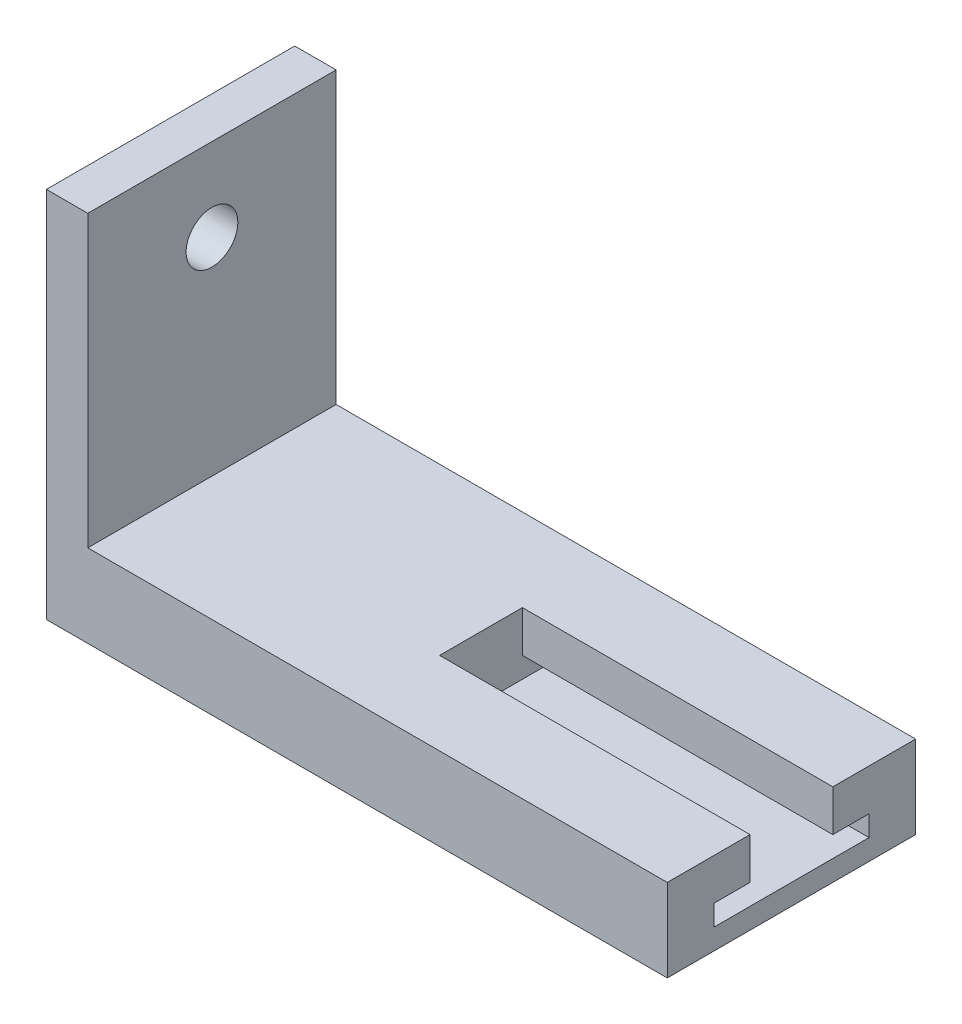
ISO-10303-21;
HEADER;
FILE_DESCRIPTION(('STEP AP214'),'2;1');
FILE_NAME('part.step','',(''),(''),'','','');
FILE_SCHEMA(('AUTOMOTIVE_DESIGN { 1 0 10303 214 1 1 1 1 }'));
ENDSEC;
DATA;
#1=APPLICATION_CONTEXT('core data for automotive mechanical design processes');
#2=APPLICATION_PROTOCOL_DEFINITION('international standard','automotive_design',2000,#1);
#3=PRODUCT_CONTEXT('',#1,'mechanical');
#4=PRODUCT('Part','Part','',(#3));
#5=PRODUCT_RELATED_PRODUCT_CATEGORY('part','',(#4));
#6=PRODUCT_DEFINITION_FORMATION('','',#4);
#7=PRODUCT_DEFINITION_CONTEXT('part definition',#1,'design');
#8=PRODUCT_DEFINITION('design','',#6,#7);
#9=PRODUCT_DEFINITION_SHAPE('','',#8);
#10=(LENGTH_UNIT() NAMED_UNIT(*) SI_UNIT(.MILLI.,.METRE.));
#11=(NAMED_UNIT(*) PLANE_ANGLE_UNIT() SI_UNIT($,.RADIAN.));
#12=(NAMED_UNIT(*) SI_UNIT($,.STERADIAN.) SOLID_ANGLE_UNIT());
#13=UNCERTAINTY_MEASURE_WITH_UNIT(LENGTH_MEASURE(1.E-05),#10,'distance_accuracy_value','');
#14=(GEOMETRIC_REPRESENTATION_CONTEXT(3) GLOBAL_UNCERTAINTY_ASSIGNED_CONTEXT((#13)) GLOBAL_UNIT_ASSIGNED_CONTEXT((#10,
#11,#12)) REPRESENTATION_CONTEXT('',''));
#15=CARTESIAN_POINT('',(0.,0.,0.));
#16=DIRECTION('',(0.,0.,1.));
#17=DIRECTION('',(1.,0.,0.));
#18=AXIS2_PLACEMENT_3D('',#15,#16,#17);
#19=CARTESIAN_POINT('',(-300.,0.,60.));
#20=DIRECTION('',(0.,1.,0.));
#21=DIRECTION('',(0.,0.,1.));
#22=AXIS2_PLACEMENT_3D('',#19,#20,#21);
#23=PLANE('',#22);
#24=DIRECTION('',(1.,0.,0.));
#25=VECTOR('',#24,1.);
#26=CARTESIAN_POINT('',(-300.,0.,-60.));
#27=LINE('',#26,#25);
#28=CARTESIAN_POINT('',(-300.,0.,-60.));
#29=VERTEX_POINT('',#28);
#30=CARTESIAN_POINT('',(0.,0.,-60.));
#31=VERTEX_POINT('',#30);
#32=EDGE_CURVE('E128',#29,#31,#27,.T.);
#33=ORIENTED_EDGE('',*,*,#32,.T.);
#34=DIRECTION('',(0.,0.,-1.));
#35=VECTOR('',#34,1.);
#36=CARTESIAN_POINT('',(0.,0.,60.));
#37=LINE('',#36,#35);
#38=CARTESIAN_POINT('',(0.,0.,60.));
#39=VERTEX_POINT('',#38);
#40=EDGE_CURVE('E11',#39,#31,#37,.T.);
#41=ORIENTED_EDGE('',*,*,#40,.F.);
#42=DIRECTION('',(1.,0.,0.));
#43=VECTOR('',#42,1.);
#44=CARTESIAN_POINT('',(-300.,0.,60.));
#45=LINE('',#44,#43);
#46=CARTESIAN_POINT('',(-300.,0.,60.));
#47=VERTEX_POINT('',#46);
#48=EDGE_CURVE('E141',#47,#39,#45,.T.);
#49=ORIENTED_EDGE('',*,*,#48,.F.);
#50=DIRECTION('',(0.,0.,-1.));
#51=VECTOR('',#50,1.);
#52=CARTESIAN_POINT('',(-300.,0.,60.));
#53=LINE('',#52,#51);
#54=EDGE_CURVE('E124',#47,#29,#53,.T.);
#55=ORIENTED_EDGE('',*,*,#54,.T.);
#56=EDGE_LOOP('',(#33,#41,#49,#55));
#57=FACE_BOUND('',#56,.T.);
#58=ADVANCED_FACE('F32',(#57),#23,.F.);
#59=CARTESIAN_POINT('',(0.,0.,60.));
#60=DIRECTION('',(-1.,0.,0.));
#61=DIRECTION('',(0.,0.,1.));
#62=AXIS2_PLACEMENT_3D('',#59,#60,#61);
#63=PLANE('',#62);
#64=DIRECTION('',(0.,0.,-1.));
#65=VECTOR('',#64,1.);
#66=CARTESIAN_POINT('',(0.,40.,60.));
#67=LINE('',#66,#65);
#68=CARTESIAN_POINT('',(0.,40.,-20.));
#69=VERTEX_POINT('',#68);
#70=CARTESIAN_POINT('',(0.,40.,-60.));
#71=VERTEX_POINT('',#70);
#72=EDGE_CURVE('E144',#69,#71,#67,.T.);
#73=ORIENTED_EDGE('',*,*,#72,.F.);
#74=DIRECTION('',(0.,1.,0.));
#75=VECTOR('',#74,1.);
#76=CARTESIAN_POINT('',(0.,40.,-20.));
#77=LINE('',#76,#75);
#78=CARTESIAN_POINT('',(0.,20.,-20.));
#79=VERTEX_POINT('',#78);
#80=EDGE_CURVE('E188',#79,#69,#77,.T.);
#81=ORIENTED_EDGE('',*,*,#80,.F.);
#82=DIRECTION('',(0.,0.,1.));
#83=VECTOR('',#82,1.);
#84=CARTESIAN_POINT('',(0.,20.,-20.));
#85=LINE('',#84,#83);
#86=CARTESIAN_POINT('',(0.,20.,-37.5));
#87=VERTEX_POINT('',#86);
#88=EDGE_CURVE('E192',#87,#79,#85,.T.);
#89=ORIENTED_EDGE('',*,*,#88,.F.);
#90=DIRECTION('',(0.,1.,0.));
#91=VECTOR('',#90,1.);
#92=CARTESIAN_POINT('',(0.,20.,-37.5));
#93=LINE('',#92,#91);
#94=CARTESIAN_POINT('',(0.,10.,-37.5));
#95=VERTEX_POINT('',#94);
#96=EDGE_CURVE('E195',#95,#87,#93,.T.);
#97=ORIENTED_EDGE('',*,*,#96,.F.);
#98=DIRECTION('',(0.,0.,-1.));
#99=VECTOR('',#98,1.);
#100=CARTESIAN_POINT('',(0.,10.,-37.5));
#101=LINE('',#100,#99);
#102=CARTESIAN_POINT('',(0.,9.99999999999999,37.5));
#103=VERTEX_POINT('',#102);
#104=EDGE_CURVE('E198',#103,#95,#101,.T.);
#105=ORIENTED_EDGE('',*,*,#104,.F.);
#106=DIRECTION('',(0.,-1.,0.));
#107=VECTOR('',#106,1.);
#108=CARTESIAN_POINT('',(0.,9.99999999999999,37.5));
#109=LINE('',#108,#107);
#110=CARTESIAN_POINT('',(0.,20.,37.5));
#111=VERTEX_POINT('',#110);
#112=EDGE_CURVE('E201',#111,#103,#109,.T.);
#113=ORIENTED_EDGE('',*,*,#112,.F.);
#114=DIRECTION('',(0.,0.,1.));
#115=VECTOR('',#114,1.);
#116=CARTESIAN_POINT('',(0.,20.,37.5));
#117=LINE('',#116,#115);
#118=CARTESIAN_POINT('',(0.,20.,20.));
#119=VERTEX_POINT('',#118);
#120=EDGE_CURVE('E204',#119,#111,#117,.T.);
#121=ORIENTED_EDGE('',*,*,#120,.F.);
#122=DIRECTION('',(0.,-1.,0.));
#123=VECTOR('',#122,1.);
#124=CARTESIAN_POINT('',(0.,20.,20.));
#125=LINE('',#124,#123);
#126=CARTESIAN_POINT('',(0.,40.,20.));
#127=VERTEX_POINT('',#126);
#128=EDGE_CURVE('E207',#127,#119,#125,.T.);
#129=ORIENTED_EDGE('',*,*,#128,.F.);
#130=CARTESIAN_POINT('',(0.,40.,60.));
#131=VERTEX_POINT('',#130);
#132=EDGE_CURVE('E39',#131,#127,#67,.T.);
#133=ORIENTED_EDGE('',*,*,#132,.F.);
#134=DIRECTION('',(0.,1.,0.));
#135=VECTOR('',#134,1.);
#136=CARTESIAN_POINT('',(0.,0.,60.));
#137=LINE('',#136,#135);
#138=EDGE_CURVE('E90',#39,#131,#137,.T.);
#139=ORIENTED_EDGE('',*,*,#138,.F.);
#140=ORIENTED_EDGE('',*,*,#40,.T.);
#141=DIRECTION('',(0.,1.,0.));
#142=VECTOR('',#141,1.);
#143=CARTESIAN_POINT('',(0.,0.,-60.));
#144=LINE('',#143,#142);
#145=EDGE_CURVE('E131',#31,#71,#144,.T.);
#146=ORIENTED_EDGE('',*,*,#145,.T.);
#147=EDGE_LOOP('',(#73,#81,#89,#97,#105,#113,#121,#129,#133,#139,#140,#146));
#148=FACE_BOUND('',#147,.T.);
#149=ADVANCED_FACE('F155',(#148),#63,.F.);
#150=CARTESIAN_POINT('',(0.,40.,60.));
#151=DIRECTION('',(0.,-1.,0.));
#152=DIRECTION('',(1.,0.,0.));
#153=AXIS2_PLACEMENT_3D('',#150,#151,#152);
#154=PLANE('',#153);
#155=DIRECTION('',(0.,0.,1.));
#156=VECTOR('',#155,1.);
#157=CARTESIAN_POINT('',(-150.,40.,20.));
#158=LINE('',#157,#156);
#159=CARTESIAN_POINT('',(-150.,40.,-20.));
#160=VERTEX_POINT('',#159);
#161=CARTESIAN_POINT('',(-150.,40.,20.));
#162=VERTEX_POINT('',#161);
#163=EDGE_CURVE('E191',#160,#162,#158,.T.);
#164=ORIENTED_EDGE('',*,*,#163,.F.);
#165=DIRECTION('',(1.,0.,0.));
#166=VECTOR('',#165,1.);
#167=CARTESIAN_POINT('',(-150.,40.,-20.));
#168=LINE('',#167,#166);
#169=EDGE_CURVE('E132',#160,#69,#168,.T.);
#170=ORIENTED_EDGE('',*,*,#169,.T.);
#171=ORIENTED_EDGE('',*,*,#72,.T.);
#172=DIRECTION('',(-1.,0.,0.));
#173=VECTOR('',#172,1.);
#174=CARTESIAN_POINT('',(0.,40.,-60.));
#175=LINE('',#174,#173);
#176=CARTESIAN_POINT('',(-280.,40.,-60.));
#177=VERTEX_POINT('',#176);
#178=EDGE_CURVE('E135',#71,#177,#175,.T.);
#179=ORIENTED_EDGE('',*,*,#178,.T.);
#180=DIRECTION('',(0.,0.,-1.));
#181=VECTOR('',#180,1.);
#182=CARTESIAN_POINT('',(-280.,40.,60.));
#183=LINE('',#182,#181);
#184=CARTESIAN_POINT('',(-280.,40.,60.));
#185=VERTEX_POINT('',#184);
#186=EDGE_CURVE('E119',#185,#177,#183,.T.);
#187=ORIENTED_EDGE('',*,*,#186,.F.);
#188=DIRECTION('',(-1.,0.,0.));
#189=VECTOR('',#188,1.);
#190=CARTESIAN_POINT('',(0.,40.,60.));
#191=LINE('',#190,#189);
#192=EDGE_CURVE('E107',#131,#185,#191,.T.);
#193=ORIENTED_EDGE('',*,*,#192,.F.);
#194=ORIENTED_EDGE('',*,*,#132,.T.);
#195=DIRECTION('',(1.,0.,0.));
#196=VECTOR('',#195,1.);
#197=CARTESIAN_POINT('',(-150.,40.,20.));
#198=LINE('',#197,#196);
#199=EDGE_CURVE('E166',#162,#127,#198,.T.);
#200=ORIENTED_EDGE('',*,*,#199,.F.);
#201=EDGE_LOOP('',(#164,#170,#171,#179,#187,#193,#194,#200));
#202=FACE_BOUND('',#201,.T.);
#203=ADVANCED_FACE('F152',(#202),#154,.F.);
#204=CARTESIAN_POINT('',(-280.,40.,60.));
#205=DIRECTION('',(-1.,0.,0.));
#206=DIRECTION('',(0.,-1.,0.));
#207=AXIS2_PLACEMENT_3D('',#204,#205,#206);
#208=PLANE('',#207);
#209=CARTESIAN_POINT('',(-280.,140.,0.));
#210=DIRECTION('',(1.,0.,0.));
#211=DIRECTION('',(0.,1.,0.));
#212=AXIS2_PLACEMENT_3D('',#209,#210,#211);
#213=CIRCLE('',#212,12.5);
#214=CARTESIAN_POINT('',(-280.,152.5,0.));
#215=VERTEX_POINT('',#214);
#216=EDGE_CURVE('E230',#215,#215,#213,.T.);
#217=ORIENTED_EDGE('',*,*,#216,.F.);
#218=EDGE_LOOP('',(#217));
#219=FACE_BOUND('',#218,.T.);
#220=DIRECTION('',(0.,1.,0.));
#221=VECTOR('',#220,1.);
#222=CARTESIAN_POINT('',(-280.,40.,-60.));
#223=LINE('',#222,#221);
#224=CARTESIAN_POINT('',(-280.,180.,-60.));
#225=VERTEX_POINT('',#224);
#226=EDGE_CURVE('E116',#177,#225,#223,.T.);
#227=ORIENTED_EDGE('',*,*,#226,.T.);
#228=DIRECTION('',(0.,0.,-1.));
#229=VECTOR('',#228,1.);
#230=CARTESIAN_POINT('',(-280.,180.,60.));
#231=LINE('',#230,#229);
#232=CARTESIAN_POINT('',(-280.,180.,60.));
#233=VERTEX_POINT('',#232);
#234=EDGE_CURVE('E113',#233,#225,#231,.T.);
#235=ORIENTED_EDGE('',*,*,#234,.F.);
#236=DIRECTION('',(0.,1.,0.));
#237=VECTOR('',#236,1.);
#238=CARTESIAN_POINT('',(-280.,40.,60.));
#239=LINE('',#238,#237);
#240=EDGE_CURVE('E100',#185,#233,#239,.T.);
#241=ORIENTED_EDGE('',*,*,#240,.F.);
#242=ORIENTED_EDGE('',*,*,#186,.T.);
#243=EDGE_LOOP('',(#227,#235,#241,#242));
#244=FACE_BOUND('',#243,.T.);
#245=ADVANCED_FACE('F114',(#219,#244),#208,.F.);
#246=CARTESIAN_POINT('',(-280.,180.,60.));
#247=DIRECTION('',(0.,-1.,0.));
#248=DIRECTION('',(0.,0.,-1.));
#249=AXIS2_PLACEMENT_3D('',#246,#247,#248);
#250=PLANE('',#249);
#251=DIRECTION('',(-1.,0.,0.));
#252=VECTOR('',#251,1.);
#253=CARTESIAN_POINT('',(-280.,180.,-60.));
#254=LINE('',#253,#252);
#255=CARTESIAN_POINT('',(-300.,180.,-60.));
#256=VERTEX_POINT('',#255);
#257=EDGE_CURVE('E138',#225,#256,#254,.T.);
#258=ORIENTED_EDGE('',*,*,#257,.T.);
#259=DIRECTION('',(0.,0.,-1.));
#260=VECTOR('',#259,1.);
#261=CARTESIAN_POINT('',(-300.,180.,60.));
#262=LINE('',#261,#260);
#263=CARTESIAN_POINT('',(-300.,180.,60.));
#264=VERTEX_POINT('',#263);
#265=EDGE_CURVE('E120',#264,#256,#262,.T.);
#266=ORIENTED_EDGE('',*,*,#265,.F.);
#267=DIRECTION('',(-1.,0.,0.));
#268=VECTOR('',#267,1.);
#269=CARTESIAN_POINT('',(-280.,180.,60.));
#270=LINE('',#269,#268);
#271=EDGE_CURVE('E104',#233,#264,#270,.T.);
#272=ORIENTED_EDGE('',*,*,#271,.F.);
#273=ORIENTED_EDGE('',*,*,#234,.T.);
#274=EDGE_LOOP('',(#258,#266,#272,#273));
#275=FACE_BOUND('',#274,.T.);
#276=ADVANCED_FACE('F122',(#275),#250,.F.);
#277=CARTESIAN_POINT('',(-300.,180.,60.));
#278=DIRECTION('',(1.,0.,0.));
#279=DIRECTION('',(0.,0.,-1.));
#280=AXIS2_PLACEMENT_3D('',#277,#278,#279);
#281=PLANE('',#280);
#282=CARTESIAN_POINT('',(-300.,140.,0.));
#283=DIRECTION('',(1.,0.,0.));
#284=DIRECTION('',(0.,1.,0.));
#285=AXIS2_PLACEMENT_3D('',#282,#283,#284);
#286=CIRCLE('',#285,12.5);
#287=CARTESIAN_POINT('',(-300.,152.5,0.));
#288=VERTEX_POINT('',#287);
#289=EDGE_CURVE('E210',#288,#288,#286,.T.);
#290=ORIENTED_EDGE('',*,*,#289,.T.);
#291=EDGE_LOOP('',(#290));
#292=FACE_BOUND('',#291,.T.);
#293=DIRECTION('',(0.,-1.,0.));
#294=VECTOR('',#293,1.);
#295=CARTESIAN_POINT('',(-300.,180.,-60.));
#296=LINE('',#295,#294);
#297=EDGE_CURVE('E82',#256,#29,#296,.T.);
#298=ORIENTED_EDGE('',*,*,#297,.T.);
#299=ORIENTED_EDGE('',*,*,#54,.F.);
#300=DIRECTION('',(0.,-1.,0.));
#301=VECTOR('',#300,1.);
#302=CARTESIAN_POINT('',(-300.,180.,60.));
#303=LINE('',#302,#301);
#304=EDGE_CURVE('E55',#264,#47,#303,.T.);
#305=ORIENTED_EDGE('',*,*,#304,.F.);
#306=ORIENTED_EDGE('',*,*,#265,.T.);
#307=EDGE_LOOP('',(#298,#299,#305,#306));
#308=FACE_BOUND('',#307,.T.);
#309=ADVANCED_FACE('F160',(#292,#308),#281,.F.);
#310=CARTESIAN_POINT('',(0.,0.,60.));
#311=DIRECTION('',(0.,0.,1.));
#312=DIRECTION('',(1.,0.,0.));
#313=AXIS2_PLACEMENT_3D('',#310,#311,#312);
#314=PLANE('',#313);
#315=ORIENTED_EDGE('',*,*,#48,.T.);
#316=ORIENTED_EDGE('',*,*,#138,.T.);
#317=ORIENTED_EDGE('',*,*,#192,.T.);
#318=ORIENTED_EDGE('',*,*,#240,.T.);
#319=ORIENTED_EDGE('',*,*,#271,.T.);
#320=ORIENTED_EDGE('',*,*,#304,.T.);
#321=EDGE_LOOP('',(#315,#316,#317,#318,#319,#320));
#322=FACE_BOUND('',#321,.T.);
#323=ADVANCED_FACE('F102',(#322),#314,.T.);
#324=CARTESIAN_POINT('',(0.,0.,-60.));
#325=DIRECTION('',(0.,0.,1.));
#326=DIRECTION('',(1.,0.,0.));
#327=AXIS2_PLACEMENT_3D('',#324,#325,#326);
#328=PLANE('',#327);
#329=ORIENTED_EDGE('',*,*,#32,.F.);
#330=ORIENTED_EDGE('',*,*,#297,.F.);
#331=ORIENTED_EDGE('',*,*,#257,.F.);
#332=ORIENTED_EDGE('',*,*,#226,.F.);
#333=ORIENTED_EDGE('',*,*,#178,.F.);
#334=ORIENTED_EDGE('',*,*,#145,.F.);
#335=EDGE_LOOP('',(#329,#330,#331,#332,#333,#334));
#336=FACE_BOUND('',#335,.T.);
#337=ADVANCED_FACE('F159',(#336),#328,.F.);
#338=CARTESIAN_POINT('',(-150.,40.,-20.));
#339=DIRECTION('',(0.,0.,-1.));
#340=DIRECTION('',(0.,1.,0.));
#341=AXIS2_PLACEMENT_3D('',#338,#339,#340);
#342=PLANE('',#341);
#343=ORIENTED_EDGE('',*,*,#80,.T.);
#344=ORIENTED_EDGE('',*,*,#169,.F.);
#345=DIRECTION('',(0.,1.,0.));
#346=VECTOR('',#345,1.);
#347=CARTESIAN_POINT('',(-150.,40.,-20.));
#348=LINE('',#347,#346);
#349=CARTESIAN_POINT('',(-150.,20.,-20.));
#350=VERTEX_POINT('',#349);
#351=EDGE_CURVE('E46',#350,#160,#348,.T.);
#352=ORIENTED_EDGE('',*,*,#351,.F.);
#353=DIRECTION('',(1.,0.,0.));
#354=VECTOR('',#353,1.);
#355=CARTESIAN_POINT('',(-150.,20.,-20.));
#356=LINE('',#355,#354);
#357=EDGE_CURVE('E184',#350,#79,#356,.T.);
#358=ORIENTED_EDGE('',*,*,#357,.T.);
#359=EDGE_LOOP('',(#343,#344,#352,#358));
#360=FACE_BOUND('',#359,.T.);
#361=ADVANCED_FACE('F269',(#360),#342,.F.);
#362=CARTESIAN_POINT('',(-150.,20.,-20.));
#363=DIRECTION('',(0.,1.,0.));
#364=DIRECTION('',(0.,0.,1.));
#365=AXIS2_PLACEMENT_3D('',#362,#363,#364);
#366=PLANE('',#365);
#367=ORIENTED_EDGE('',*,*,#88,.T.);
#368=ORIENTED_EDGE('',*,*,#357,.F.);
#369=DIRECTION('',(0.,0.,1.));
#370=VECTOR('',#369,1.);
#371=CARTESIAN_POINT('',(-150.,20.,-20.));
#372=LINE('',#371,#370);
#373=CARTESIAN_POINT('',(-150.,20.,-37.5));
#374=VERTEX_POINT('',#373);
#375=EDGE_CURVE('E212',#374,#350,#372,.T.);
#376=ORIENTED_EDGE('',*,*,#375,.F.);
#377=DIRECTION('',(1.,0.,0.));
#378=VECTOR('',#377,1.);
#379=CARTESIAN_POINT('',(-150.,20.,-37.5));
#380=LINE('',#379,#378);
#381=EDGE_CURVE('E181',#374,#87,#380,.T.);
#382=ORIENTED_EDGE('',*,*,#381,.T.);
#383=EDGE_LOOP('',(#367,#368,#376,#382));
#384=FACE_BOUND('',#383,.T.);
#385=ADVANCED_FACE('F274',(#384),#366,.F.);
#386=CARTESIAN_POINT('',(-150.,20.,-37.5));
#387=DIRECTION('',(0.,0.,-1.));
#388=DIRECTION('',(0.,1.,0.));
#389=AXIS2_PLACEMENT_3D('',#386,#387,#388);
#390=PLANE('',#389);
#391=ORIENTED_EDGE('',*,*,#96,.T.);
#392=ORIENTED_EDGE('',*,*,#381,.F.);
#393=DIRECTION('',(0.,1.,0.));
#394=VECTOR('',#393,1.);
#395=CARTESIAN_POINT('',(-150.,20.,-37.5));
#396=LINE('',#395,#394);
#397=CARTESIAN_POINT('',(-150.,10.,-37.5));
#398=VERTEX_POINT('',#397);
#399=EDGE_CURVE('E214',#398,#374,#396,.T.);
#400=ORIENTED_EDGE('',*,*,#399,.F.);
#401=DIRECTION('',(1.,0.,0.));
#402=VECTOR('',#401,1.);
#403=CARTESIAN_POINT('',(-150.,10.,-37.5));
#404=LINE('',#403,#402);
#405=EDGE_CURVE('E178',#398,#95,#404,.T.);
#406=ORIENTED_EDGE('',*,*,#405,.T.);
#407=EDGE_LOOP('',(#391,#392,#400,#406));
#408=FACE_BOUND('',#407,.T.);
#409=ADVANCED_FACE('F286',(#408),#390,.F.);
#410=CARTESIAN_POINT('',(-150.,10.,-37.5));
#411=DIRECTION('',(0.,-1.,0.));
#412=DIRECTION('',(0.,0.,-1.));
#413=AXIS2_PLACEMENT_3D('',#410,#411,#412);
#414=PLANE('',#413);
#415=ORIENTED_EDGE('',*,*,#104,.T.);
#416=ORIENTED_EDGE('',*,*,#405,.F.);
#417=DIRECTION('',(0.,0.,-1.));
#418=VECTOR('',#417,1.);
#419=CARTESIAN_POINT('',(-150.,10.,-37.5));
#420=LINE('',#419,#418);
#421=CARTESIAN_POINT('',(-150.,9.99999999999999,37.5));
#422=VERTEX_POINT('',#421);
#423=EDGE_CURVE('E217',#422,#398,#420,.T.);
#424=ORIENTED_EDGE('',*,*,#423,.F.);
#425=DIRECTION('',(1.,0.,0.));
#426=VECTOR('',#425,1.);
#427=CARTESIAN_POINT('',(-150.,9.99999999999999,37.5));
#428=LINE('',#427,#426);
#429=EDGE_CURVE('E175',#422,#103,#428,.T.);
#430=ORIENTED_EDGE('',*,*,#429,.T.);
#431=EDGE_LOOP('',(#415,#416,#424,#430));
#432=FACE_BOUND('',#431,.T.);
#433=ADVANCED_FACE('F296',(#432),#414,.F.);
#434=CARTESIAN_POINT('',(-150.,9.99999999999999,37.5));
#435=DIRECTION('',(0.,0.,1.));
#436=DIRECTION('',(1.,0.,0.));
#437=AXIS2_PLACEMENT_3D('',#434,#435,#436);
#438=PLANE('',#437);
#439=ORIENTED_EDGE('',*,*,#112,.T.);
#440=ORIENTED_EDGE('',*,*,#429,.F.);
#441=DIRECTION('',(0.,-1.,0.));
#442=VECTOR('',#441,1.);
#443=CARTESIAN_POINT('',(-150.,9.99999999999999,37.5));
#444=LINE('',#443,#442);
#445=CARTESIAN_POINT('',(-150.,20.,37.5));
#446=VERTEX_POINT('',#445);
#447=EDGE_CURVE('E220',#446,#422,#444,.T.);
#448=ORIENTED_EDGE('',*,*,#447,.F.);
#449=DIRECTION('',(1.,0.,0.));
#450=VECTOR('',#449,1.);
#451=CARTESIAN_POINT('',(-150.,20.,37.5));
#452=LINE('',#451,#450);
#453=EDGE_CURVE('E172',#446,#111,#452,.T.);
#454=ORIENTED_EDGE('',*,*,#453,.T.);
#455=EDGE_LOOP('',(#439,#440,#448,#454));
#456=FACE_BOUND('',#455,.T.);
#457=ADVANCED_FACE('F306',(#456),#438,.F.);
#458=CARTESIAN_POINT('',(-150.,20.,37.5));
#459=DIRECTION('',(0.,1.,0.));
#460=DIRECTION('',(0.,0.,1.));
#461=AXIS2_PLACEMENT_3D('',#458,#459,#460);
#462=PLANE('',#461);
#463=ORIENTED_EDGE('',*,*,#120,.T.);
#464=ORIENTED_EDGE('',*,*,#453,.F.);
#465=DIRECTION('',(0.,0.,1.));
#466=VECTOR('',#465,1.);
#467=CARTESIAN_POINT('',(-150.,20.,37.5));
#468=LINE('',#467,#466);
#469=CARTESIAN_POINT('',(-150.,20.,20.));
#470=VERTEX_POINT('',#469);
#471=EDGE_CURVE('E223',#470,#446,#468,.T.);
#472=ORIENTED_EDGE('',*,*,#471,.F.);
#473=DIRECTION('',(1.,0.,0.));
#474=VECTOR('',#473,1.);
#475=CARTESIAN_POINT('',(-150.,20.,20.));
#476=LINE('',#475,#474);
#477=EDGE_CURVE('E169',#470,#119,#476,.T.);
#478=ORIENTED_EDGE('',*,*,#477,.T.);
#479=EDGE_LOOP('',(#463,#464,#472,#478));
#480=FACE_BOUND('',#479,.T.);
#481=ADVANCED_FACE('F316',(#480),#462,.F.);
#482=CARTESIAN_POINT('',(-150.,20.,20.));
#483=DIRECTION('',(0.,0.,1.));
#484=DIRECTION('',(1.,0.,0.));
#485=AXIS2_PLACEMENT_3D('',#482,#483,#484);
#486=PLANE('',#485);
#487=ORIENTED_EDGE('',*,*,#128,.T.);
#488=ORIENTED_EDGE('',*,*,#477,.F.);
#489=DIRECTION('',(0.,-1.,0.));
#490=VECTOR('',#489,1.);
#491=CARTESIAN_POINT('',(-150.,20.,20.));
#492=LINE('',#491,#490);
#493=EDGE_CURVE('E226',#162,#470,#492,.T.);
#494=ORIENTED_EDGE('',*,*,#493,.F.);
#495=ORIENTED_EDGE('',*,*,#199,.T.);
#496=EDGE_LOOP('',(#487,#488,#494,#495));
#497=FACE_BOUND('',#496,.T.);
#498=ADVANCED_FACE('F326',(#497),#486,.F.);
#499=CARTESIAN_POINT('',(-150.,40.,-20.));
#500=DIRECTION('',(-1.,0.,0.));
#501=DIRECTION('',(0.,0.,1.));
#502=AXIS2_PLACEMENT_3D('',#499,#500,#501);
#503=PLANE('',#502);
#504=ORIENTED_EDGE('',*,*,#163,.T.);
#505=ORIENTED_EDGE('',*,*,#493,.T.);
#506=ORIENTED_EDGE('',*,*,#471,.T.);
#507=ORIENTED_EDGE('',*,*,#447,.T.);
#508=ORIENTED_EDGE('',*,*,#423,.T.);
#509=ORIENTED_EDGE('',*,*,#399,.T.);
#510=ORIENTED_EDGE('',*,*,#375,.T.);
#511=ORIENTED_EDGE('',*,*,#351,.T.);
#512=EDGE_LOOP('',(#504,#505,#506,#507,#508,#509,#510,#511));
#513=FACE_BOUND('',#512,.T.);
#514=ADVANCED_FACE('F240',(#513),#503,.F.);
#515=CARTESIAN_POINT('',(-300.,140.,0.));
#516=DIRECTION('',(1.,0.,0.));
#517=DIRECTION('',(0.,1.,0.));
#518=AXIS2_PLACEMENT_3D('',#515,#516,#517);
#519=CYLINDRICAL_SURFACE('',#518,12.5);
#520=ORIENTED_EDGE('',*,*,#289,.F.);
#521=EDGE_LOOP('',(#520));
#522=FACE_BOUND('',#521,.T.);
#523=ORIENTED_EDGE('',*,*,#216,.T.);
#524=EDGE_LOOP('',(#523));
#525=FACE_BOUND('',#524,.T.);
#526=ADVANCED_FACE('F237',(#522,#525),#519,.F.);
#527=CLOSED_SHELL('',(#58,#149,#203,#245,#276,#309,#323,#337,#361,#385,#409,#433,#457,#481,#498,
#514,#526));
#528=MANIFOLD_SOLID_BREP('B2',#527);
#529=ADVANCED_BREP_SHAPE_REPRESENTATION('',(#18,#528),#14);
#530=SHAPE_DEFINITION_REPRESENTATION(#9,#529);
ENDSEC;
END-ISO-10303-21;
